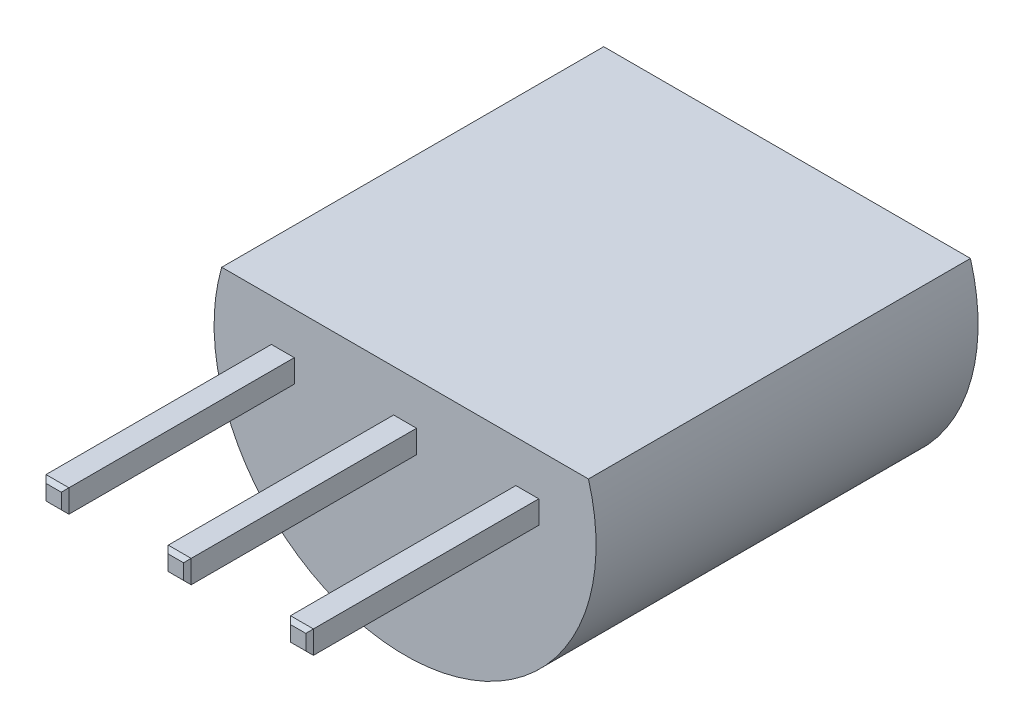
ISO-10303-21;
HEADER;
FILE_DESCRIPTION(('STEP AP214'),'2;1');
FILE_NAME('part.step','',(''),(''),'','','');
FILE_SCHEMA(('AUTOMOTIVE_DESIGN { 1 0 10303 214 1 1 1 1 }'));
ENDSEC;
DATA;
#1=APPLICATION_CONTEXT('core data for automotive mechanical design processes');
#2=APPLICATION_PROTOCOL_DEFINITION('international standard','automotive_design',2000,#1);
#3=PRODUCT_CONTEXT('',#1,'mechanical');
#4=PRODUCT('Part','Part','',(#3));
#5=PRODUCT_RELATED_PRODUCT_CATEGORY('part','',(#4));
#6=PRODUCT_DEFINITION_FORMATION('','',#4);
#7=PRODUCT_DEFINITION_CONTEXT('part definition',#1,'design');
#8=PRODUCT_DEFINITION('design','',#6,#7);
#9=PRODUCT_DEFINITION_SHAPE('','',#8);
#10=(LENGTH_UNIT() NAMED_UNIT(*) SI_UNIT(.MILLI.,.METRE.));
#11=(NAMED_UNIT(*) PLANE_ANGLE_UNIT() SI_UNIT($,.RADIAN.));
#12=(NAMED_UNIT(*) SI_UNIT($,.STERADIAN.) SOLID_ANGLE_UNIT());
#13=UNCERTAINTY_MEASURE_WITH_UNIT(LENGTH_MEASURE(1.E-05),#10,'distance_accuracy_value','');
#14=(GEOMETRIC_REPRESENTATION_CONTEXT(3) GLOBAL_UNCERTAINTY_ASSIGNED_CONTEXT((#13)) GLOBAL_UNIT_ASSIGNED_CONTEXT((#10,
#11,#12)) REPRESENTATION_CONTEXT('',''));
#15=CARTESIAN_POINT('',(0.,0.,0.));
#16=DIRECTION('',(0.,0.,1.));
#17=DIRECTION('',(1.,0.,0.));
#18=AXIS2_PLACEMENT_3D('',#15,#16,#17);
#19=CARTESIAN_POINT('',(0.,0.,0.));
#20=DIRECTION('',(0.,0.,1.));
#21=DIRECTION('',(1.,0.,0.));
#22=AXIS2_PLACEMENT_3D('',#19,#20,#21);
#23=PLANE('',#22);
#24=DIRECTION('',(1.,0.,0.));
#25=VECTOR('',#24,1.);
#26=CARTESIAN_POINT('',(0.,0.7,0.));
#27=LINE('',#26,#25);
#28=CARTESIAN_POINT('',(-2.4,0.7,0.));
#29=VERTEX_POINT('',#28);
#30=CARTESIAN_POINT('',(2.4,0.7,0.));
#31=VERTEX_POINT('',#30);
#32=EDGE_CURVE('E176',#29,#31,#27,.T.);
#33=ORIENTED_EDGE('',*,*,#32,.F.);
#34=CARTESIAN_POINT('',(0.,0.,0.));
#35=DIRECTION('',(0.,0.,1.));
#36=DIRECTION('',(1.,0.,0.));
#37=AXIS2_PLACEMENT_3D('',#34,#35,#36);
#38=CIRCLE('',#37,2.5);
#39=EDGE_CURVE('E175',#29,#31,#38,.T.);
#40=ORIENTED_EDGE('',*,*,#39,.T.);
#41=EDGE_LOOP('',(#33,#40));
#42=FACE_BOUND('',#41,.T.);
#43=DIRECTION('',(0.,-1.,0.));
#44=VECTOR('',#43,1.);
#45=CARTESIAN_POINT('',(1.45,0.15,0.));
#46=LINE('',#45,#44);
#47=CARTESIAN_POINT('',(1.45,0.15,0.));
#48=VERTEX_POINT('',#47);
#49=CARTESIAN_POINT('',(1.45,-0.15,0.));
#50=VERTEX_POINT('',#49);
#51=EDGE_CURVE('E319',#48,#50,#46,.T.);
#52=ORIENTED_EDGE('',*,*,#51,.F.);
#53=DIRECTION('',(-1.,0.,0.));
#54=VECTOR('',#53,1.);
#55=CARTESIAN_POINT('',(1.45,0.15,0.));
#56=LINE('',#55,#54);
#57=CARTESIAN_POINT('',(1.75,0.15,0.));
#58=VERTEX_POINT('',#57);
#59=EDGE_CURVE('E316',#58,#48,#56,.T.);
#60=ORIENTED_EDGE('',*,*,#59,.F.);
#61=DIRECTION('',(0.,1.,0.));
#62=VECTOR('',#61,1.);
#63=CARTESIAN_POINT('',(1.75,0.15,0.));
#64=LINE('',#63,#62);
#65=CARTESIAN_POINT('',(1.75,-0.15,0.));
#66=VERTEX_POINT('',#65);
#67=EDGE_CURVE('E325',#66,#58,#64,.T.);
#68=ORIENTED_EDGE('',*,*,#67,.F.);
#69=DIRECTION('',(1.,0.,0.));
#70=VECTOR('',#69,1.);
#71=CARTESIAN_POINT('',(1.45,-0.15,0.));
#72=LINE('',#71,#70);
#73=EDGE_CURVE('E322',#50,#66,#72,.T.);
#74=ORIENTED_EDGE('',*,*,#73,.F.);
#75=EDGE_LOOP('',(#52,#60,#68,#74));
#76=FACE_BOUND('',#75,.T.);
#77=DIRECTION('',(-1.,0.,0.));
#78=VECTOR('',#77,1.);
#79=CARTESIAN_POINT('',(-1.45,0.15,0.));
#80=LINE('',#79,#78);
#81=CARTESIAN_POINT('',(-1.45,0.15,0.));
#82=VERTEX_POINT('',#81);
#83=CARTESIAN_POINT('',(-1.75,0.15,0.));
#84=VERTEX_POINT('',#83);
#85=EDGE_CURVE('E338',#82,#84,#80,.T.);
#86=ORIENTED_EDGE('',*,*,#85,.F.);
#87=DIRECTION('',(0.,1.,0.));
#88=VECTOR('',#87,1.);
#89=CARTESIAN_POINT('',(-1.45,0.15,0.));
#90=LINE('',#89,#88);
#91=CARTESIAN_POINT('',(-1.45,-0.15,0.));
#92=VERTEX_POINT('',#91);
#93=EDGE_CURVE('E336',#92,#82,#90,.T.);
#94=ORIENTED_EDGE('',*,*,#93,.F.);
#95=DIRECTION('',(1.,0.,0.));
#96=VECTOR('',#95,1.);
#97=CARTESIAN_POINT('',(-1.45,-0.15,0.));
#98=LINE('',#97,#96);
#99=CARTESIAN_POINT('',(-1.75,-0.15,0.));
#100=VERTEX_POINT('',#99);
#101=EDGE_CURVE('E251',#100,#92,#98,.T.);
#102=ORIENTED_EDGE('',*,*,#101,.F.);
#103=DIRECTION('',(0.,-1.,0.));
#104=VECTOR('',#103,1.);
#105=CARTESIAN_POINT('',(-1.75,0.15,0.));
#106=LINE('',#105,#104);
#107=EDGE_CURVE('E341',#84,#100,#106,.T.);
#108=ORIENTED_EDGE('',*,*,#107,.F.);
#109=EDGE_LOOP('',(#86,#94,#102,#108));
#110=FACE_BOUND('',#109,.T.);
#111=DIRECTION('',(1.,0.,0.));
#112=VECTOR('',#111,1.);
#113=CARTESIAN_POINT('',(-0.15,-0.15,0.));
#114=LINE('',#113,#112);
#115=CARTESIAN_POINT('',(-0.15,-0.15,0.));
#116=VERTEX_POINT('',#115);
#117=CARTESIAN_POINT('',(0.15,-0.15,0.));
#118=VERTEX_POINT('',#117);
#119=EDGE_CURVE('E299',#116,#118,#114,.T.);
#120=ORIENTED_EDGE('',*,*,#119,.F.);
#121=DIRECTION('',(0.,-1.,0.));
#122=VECTOR('',#121,1.);
#123=CARTESIAN_POINT('',(-0.15,0.15,0.));
#124=LINE('',#123,#122);
#125=CARTESIAN_POINT('',(-0.15,0.15,0.));
#126=VERTEX_POINT('',#125);
#127=EDGE_CURVE('E296',#126,#116,#124,.T.);
#128=ORIENTED_EDGE('',*,*,#127,.F.);
#129=DIRECTION('',(-1.,0.,0.));
#130=VECTOR('',#129,1.);
#131=CARTESIAN_POINT('',(-0.15,0.15,0.));
#132=LINE('',#131,#130);
#133=CARTESIAN_POINT('',(0.15,0.15,0.));
#134=VERTEX_POINT('',#133);
#135=EDGE_CURVE('E305',#134,#126,#132,.T.);
#136=ORIENTED_EDGE('',*,*,#135,.F.);
#137=DIRECTION('',(0.,1.,0.));
#138=VECTOR('',#137,1.);
#139=CARTESIAN_POINT('',(0.15,0.15,0.));
#140=LINE('',#139,#138);
#141=EDGE_CURVE('E302',#118,#134,#140,.T.);
#142=ORIENTED_EDGE('',*,*,#141,.F.);
#143=EDGE_LOOP('',(#120,#128,#136,#142));
#144=FACE_BOUND('',#143,.T.);
#145=ADVANCED_FACE('F31',(#42,#76,#110,#144),#23,.T.);
#146=CARTESIAN_POINT('',(0.,0.,-5.));
#147=DIRECTION('',(0.,0.,1.));
#148=DIRECTION('',(1.,0.,0.));
#149=AXIS2_PLACEMENT_3D('',#146,#147,#148);
#150=CYLINDRICAL_SURFACE('',#149,2.5);
#151=DIRECTION('',(0.,0.,1.));
#152=VECTOR('',#151,1.);
#153=CARTESIAN_POINT('',(2.4,0.7,-5.));
#154=LINE('',#153,#152);
#155=CARTESIAN_POINT('',(2.4,0.7,-5.));
#156=VERTEX_POINT('',#155);
#157=EDGE_CURVE('E46',#31,#156,#154,.F.);
#158=ORIENTED_EDGE('',*,*,#157,.F.);
#159=ORIENTED_EDGE('',*,*,#39,.F.);
#160=DIRECTION('',(0.,0.,1.));
#161=VECTOR('',#160,1.);
#162=CARTESIAN_POINT('',(-2.4,0.7,-5.));
#163=LINE('',#162,#161);
#164=CARTESIAN_POINT('',(-2.4,0.7,-5.));
#165=VERTEX_POINT('',#164);
#166=EDGE_CURVE('E166',#165,#29,#163,.T.);
#167=ORIENTED_EDGE('',*,*,#166,.F.);
#168=CARTESIAN_POINT('',(0.,0.,-5.));
#169=DIRECTION('',(0.,0.,1.));
#170=DIRECTION('',(1.,0.,0.));
#171=AXIS2_PLACEMENT_3D('',#168,#169,#170);
#172=CIRCLE('',#171,2.5);
#173=EDGE_CURVE('E173',#165,#156,#172,.T.);
#174=ORIENTED_EDGE('',*,*,#173,.T.);
#175=EDGE_LOOP('',(#158,#159,#167,#174));
#176=FACE_BOUND('',#175,.T.);
#177=ADVANCED_FACE('F33',(#176),#150,.T.);
#178=CARTESIAN_POINT('',(0.,0.,-5.));
#179=DIRECTION('',(0.,0.,1.));
#180=DIRECTION('',(1.,0.,0.));
#181=AXIS2_PLACEMENT_3D('',#178,#179,#180);
#182=PLANE('',#181);
#183=ORIENTED_EDGE('',*,*,#173,.F.);
#184=DIRECTION('',(1.,0.,0.));
#185=VECTOR('',#184,1.);
#186=CARTESIAN_POINT('',(0.,0.7,-5.));
#187=LINE('',#186,#185);
#188=EDGE_CURVE('E11',#165,#156,#187,.T.);
#189=ORIENTED_EDGE('',*,*,#188,.T.);
#190=EDGE_LOOP('',(#183,#189));
#191=FACE_BOUND('',#190,.T.);
#192=ADVANCED_FACE('F178',(#191),#182,.F.);
#193=CARTESIAN_POINT('',(-1.45,0.15,3.));
#194=DIRECTION('',(-1.,0.,0.));
#195=DIRECTION('',(0.,0.,1.));
#196=AXIS2_PLACEMENT_3D('',#193,#194,#195);
#197=PLANE('',#196);
#198=DIRECTION('',(0.,0.,-1.));
#199=VECTOR('',#198,1.);
#200=CARTESIAN_POINT('',(-1.45,0.15,3.));
#201=LINE('',#200,#199);
#202=CARTESIAN_POINT('',(-1.45,0.15,2.95));
#203=VERTEX_POINT('',#202);
#204=EDGE_CURVE('E183',#203,#82,#201,.T.);
#205=ORIENTED_EDGE('',*,*,#204,.F.);
#206=DIRECTION('',(0.,-1.,0.));
#207=VECTOR('',#206,1.);
#208=CARTESIAN_POINT('',(-1.45,0.15,2.95));
#209=LINE('',#208,#207);
#210=CARTESIAN_POINT('',(-1.45,-0.15,2.95));
#211=VERTEX_POINT('',#210);
#212=EDGE_CURVE('E234',#203,#211,#209,.T.);
#213=ORIENTED_EDGE('',*,*,#212,.T.);
#214=DIRECTION('',(0.,0.,-1.));
#215=VECTOR('',#214,1.);
#216=CARTESIAN_POINT('',(-1.45,-0.15,3.));
#217=LINE('',#216,#215);
#218=EDGE_CURVE('E240',#211,#92,#217,.T.);
#219=ORIENTED_EDGE('',*,*,#218,.T.);
#220=ORIENTED_EDGE('',*,*,#93,.T.);
#221=EDGE_LOOP('',(#205,#213,#219,#220));
#222=FACE_BOUND('',#221,.T.);
#223=ADVANCED_FACE('F238',(#222),#197,.F.);
#224=CARTESIAN_POINT('',(-1.45,0.15,3.));
#225=DIRECTION('',(0.,-1.,0.));
#226=DIRECTION('',(1.,0.,0.));
#227=AXIS2_PLACEMENT_3D('',#224,#225,#226);
#228=PLANE('',#227);
#229=DIRECTION('',(0.,0.,-1.));
#230=VECTOR('',#229,1.);
#231=CARTESIAN_POINT('',(-1.75,0.15,3.));
#232=LINE('',#231,#230);
#233=CARTESIAN_POINT('',(-1.75,0.15,2.95));
#234=VERTEX_POINT('',#233);
#235=EDGE_CURVE('E346',#234,#84,#232,.T.);
#236=ORIENTED_EDGE('',*,*,#235,.F.);
#237=DIRECTION('',(1.,0.,0.));
#238=VECTOR('',#237,1.);
#239=CARTESIAN_POINT('',(-1.45,0.15,2.95));
#240=LINE('',#239,#238);
#241=EDGE_CURVE('E39',#234,#203,#240,.T.);
#242=ORIENTED_EDGE('',*,*,#241,.T.);
#243=ORIENTED_EDGE('',*,*,#204,.T.);
#244=ORIENTED_EDGE('',*,*,#85,.T.);
#245=EDGE_LOOP('',(#236,#242,#243,#244));
#246=FACE_BOUND('',#245,.T.);
#247=ADVANCED_FACE('F347',(#246),#228,.F.);
#248=CARTESIAN_POINT('',(-1.75,0.15,3.));
#249=DIRECTION('',(1.,0.,0.));
#250=DIRECTION('',(0.,0.,-1.));
#251=AXIS2_PLACEMENT_3D('',#248,#249,#250);
#252=PLANE('',#251);
#253=DIRECTION('',(0.,0.,-1.));
#254=VECTOR('',#253,1.);
#255=CARTESIAN_POINT('',(-1.75,-0.15,3.));
#256=LINE('',#255,#254);
#257=CARTESIAN_POINT('',(-1.75,-0.15,2.95));
#258=VERTEX_POINT('',#257);
#259=EDGE_CURVE('E253',#258,#100,#256,.T.);
#260=ORIENTED_EDGE('',*,*,#259,.F.);
#261=DIRECTION('',(0.,1.,0.));
#262=VECTOR('',#261,1.);
#263=CARTESIAN_POINT('',(-1.75,0.15,2.95));
#264=LINE('',#263,#262);
#265=EDGE_CURVE('E229',#258,#234,#264,.T.);
#266=ORIENTED_EDGE('',*,*,#265,.T.);
#267=ORIENTED_EDGE('',*,*,#235,.T.);
#268=ORIENTED_EDGE('',*,*,#107,.T.);
#269=EDGE_LOOP('',(#260,#266,#267,#268));
#270=FACE_BOUND('',#269,.T.);
#271=ADVANCED_FACE('F353',(#270),#252,.F.);
#272=CARTESIAN_POINT('',(-1.45,-0.15,3.));
#273=DIRECTION('',(0.,1.,0.));
#274=DIRECTION('',(-1.,0.,0.));
#275=AXIS2_PLACEMENT_3D('',#272,#273,#274);
#276=PLANE('',#275);
#277=ORIENTED_EDGE('',*,*,#218,.F.);
#278=DIRECTION('',(-1.,0.,0.));
#279=VECTOR('',#278,1.);
#280=CARTESIAN_POINT('',(-1.45,-0.15,2.95));
#281=LINE('',#280,#279);
#282=EDGE_CURVE('E232',#211,#258,#281,.T.);
#283=ORIENTED_EDGE('',*,*,#282,.T.);
#284=ORIENTED_EDGE('',*,*,#259,.T.);
#285=ORIENTED_EDGE('',*,*,#101,.T.);
#286=EDGE_LOOP('',(#277,#283,#284,#285));
#287=FACE_BOUND('',#286,.T.);
#288=ADVANCED_FACE('F247',(#287),#276,.F.);
#289=CARTESIAN_POINT('',(-1.45,-0.15,3.));
#290=DIRECTION('',(0.,0.,-1.));
#291=DIRECTION('',(-1.,0.,0.));
#292=AXIS2_PLACEMENT_3D('',#289,#290,#291);
#293=PLANE('',#292);
#294=DIRECTION('',(-1.,0.,0.));
#295=VECTOR('',#294,1.);
#296=CARTESIAN_POINT('',(-1.45,0.0999999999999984,3.));
#297=LINE('',#296,#295);
#298=CARTESIAN_POINT('',(-1.5,0.0999999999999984,3.));
#299=VERTEX_POINT('',#298);
#300=CARTESIAN_POINT('',(-1.7,0.0999999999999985,3.));
#301=VERTEX_POINT('',#300);
#302=EDGE_CURVE('E220',#299,#301,#297,.T.);
#303=ORIENTED_EDGE('',*,*,#302,.T.);
#304=DIRECTION('',(0.,-1.,0.));
#305=VECTOR('',#304,1.);
#306=CARTESIAN_POINT('',(-1.7,-0.15,3.));
#307=LINE('',#306,#305);
#308=CARTESIAN_POINT('',(-1.7,-0.0999999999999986,3.));
#309=VERTEX_POINT('',#308);
#310=EDGE_CURVE('E226',#301,#309,#307,.T.);
#311=ORIENTED_EDGE('',*,*,#310,.T.);
#312=DIRECTION('',(1.,0.,0.));
#313=VECTOR('',#312,1.);
#314=CARTESIAN_POINT('',(-1.45,-0.0999999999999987,3.));
#315=LINE('',#314,#313);
#316=CARTESIAN_POINT('',(-1.5,-0.0999999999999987,3.));
#317=VERTEX_POINT('',#316);
#318=EDGE_CURVE('E224',#309,#317,#315,.T.);
#319=ORIENTED_EDGE('',*,*,#318,.T.);
#320=DIRECTION('',(0.,1.,0.));
#321=VECTOR('',#320,1.);
#322=CARTESIAN_POINT('',(-1.5,-0.15,3.));
#323=LINE('',#322,#321);
#324=EDGE_CURVE('E222',#317,#299,#323,.T.);
#325=ORIENTED_EDGE('',*,*,#324,.T.);
#326=EDGE_LOOP('',(#303,#311,#319,#325));
#327=FACE_BOUND('',#326,.T.);
#328=ADVANCED_FACE('F360',(#327),#293,.F.);
#329=CARTESIAN_POINT('',(1.45,0.15,3.));
#330=DIRECTION('',(0.,-1.,0.));
#331=DIRECTION('',(1.,0.,0.));
#332=AXIS2_PLACEMENT_3D('',#329,#330,#331);
#333=PLANE('',#332);
#334=DIRECTION('',(0.,0.,-1.));
#335=VECTOR('',#334,1.);
#336=CARTESIAN_POINT('',(1.45,0.15,3.));
#337=LINE('',#336,#335);
#338=CARTESIAN_POINT('',(1.45,0.15,2.95));
#339=VERTEX_POINT('',#338);
#340=EDGE_CURVE('E334',#339,#48,#337,.T.);
#341=ORIENTED_EDGE('',*,*,#340,.F.);
#342=DIRECTION('',(1.,0.,0.));
#343=VECTOR('',#342,1.);
#344=CARTESIAN_POINT('',(1.45,0.15,2.95));
#345=LINE('',#344,#343);
#346=CARTESIAN_POINT('',(1.75,0.15,2.95));
#347=VERTEX_POINT('',#346);
#348=EDGE_CURVE('E200',#339,#347,#345,.T.);
#349=ORIENTED_EDGE('',*,*,#348,.T.);
#350=DIRECTION('',(0.,0.,-1.));
#351=VECTOR('',#350,1.);
#352=CARTESIAN_POINT('',(1.75,0.15,3.));
#353=LINE('',#352,#351);
#354=EDGE_CURVE('E328',#347,#58,#353,.T.);
#355=ORIENTED_EDGE('',*,*,#354,.T.);
#356=ORIENTED_EDGE('',*,*,#59,.T.);
#357=EDGE_LOOP('',(#341,#349,#355,#356));
#358=FACE_BOUND('',#357,.T.);
#359=ADVANCED_FACE('F362',(#358),#333,.F.);
#360=CARTESIAN_POINT('',(1.45,0.15,3.));
#361=DIRECTION('',(1.,0.,0.));
#362=DIRECTION('',(0.,1.,0.));
#363=AXIS2_PLACEMENT_3D('',#360,#361,#362);
#364=PLANE('',#363);
#365=DIRECTION('',(0.,0.,-1.));
#366=VECTOR('',#365,1.);
#367=CARTESIAN_POINT('',(1.45,-0.15,3.));
#368=LINE('',#367,#366);
#369=CARTESIAN_POINT('',(1.45,-0.15,2.95));
#370=VERTEX_POINT('',#369);
#371=EDGE_CURVE('E332',#370,#50,#368,.T.);
#372=ORIENTED_EDGE('',*,*,#371,.F.);
#373=DIRECTION('',(0.,1.,0.));
#374=VECTOR('',#373,1.);
#375=CARTESIAN_POINT('',(1.45,0.15,2.95));
#376=LINE('',#375,#374);
#377=EDGE_CURVE('E198',#370,#339,#376,.T.);
#378=ORIENTED_EDGE('',*,*,#377,.T.);
#379=ORIENTED_EDGE('',*,*,#340,.T.);
#380=ORIENTED_EDGE('',*,*,#51,.T.);
#381=EDGE_LOOP('',(#372,#378,#379,#380));
#382=FACE_BOUND('',#381,.T.);
#383=ADVANCED_FACE('F368',(#382),#364,.F.);
#384=CARTESIAN_POINT('',(1.45,-0.15,3.));
#385=DIRECTION('',(0.,1.,0.));
#386=DIRECTION('',(-1.,0.,0.));
#387=AXIS2_PLACEMENT_3D('',#384,#385,#386);
#388=PLANE('',#387);
#389=DIRECTION('',(0.,0.,-1.));
#390=VECTOR('',#389,1.);
#391=CARTESIAN_POINT('',(1.75,-0.15,3.));
#392=LINE('',#391,#390);
#393=CARTESIAN_POINT('',(1.75,-0.15,2.95));
#394=VERTEX_POINT('',#393);
#395=EDGE_CURVE('E330',#394,#66,#392,.T.);
#396=ORIENTED_EDGE('',*,*,#395,.F.);
#397=DIRECTION('',(-1.,0.,0.));
#398=VECTOR('',#397,1.);
#399=CARTESIAN_POINT('',(1.45,-0.15,2.95));
#400=LINE('',#399,#398);
#401=EDGE_CURVE('E196',#394,#370,#400,.T.);
#402=ORIENTED_EDGE('',*,*,#401,.T.);
#403=ORIENTED_EDGE('',*,*,#371,.T.);
#404=ORIENTED_EDGE('',*,*,#73,.T.);
#405=EDGE_LOOP('',(#396,#402,#403,#404));
#406=FACE_BOUND('',#405,.T.);
#407=ADVANCED_FACE('F417',(#406),#388,.F.);
#408=CARTESIAN_POINT('',(1.75,0.15,3.));
#409=DIRECTION('',(-1.,0.,0.));
#410=DIRECTION('',(0.,-1.,0.));
#411=AXIS2_PLACEMENT_3D('',#408,#409,#410);
#412=PLANE('',#411);
#413=ORIENTED_EDGE('',*,*,#354,.F.);
#414=DIRECTION('',(0.,-1.,0.));
#415=VECTOR('',#414,1.);
#416=CARTESIAN_POINT('',(1.75,0.15,2.95));
#417=LINE('',#416,#415);
#418=EDGE_CURVE('E193',#347,#394,#417,.T.);
#419=ORIENTED_EDGE('',*,*,#418,.T.);
#420=ORIENTED_EDGE('',*,*,#395,.T.);
#421=ORIENTED_EDGE('',*,*,#67,.T.);
#422=EDGE_LOOP('',(#413,#419,#420,#421));
#423=FACE_BOUND('',#422,.T.);
#424=ADVANCED_FACE('F427',(#423),#412,.F.);
#425=CARTESIAN_POINT('',(1.75,0.15,3.));
#426=DIRECTION('',(0.,0.,-1.));
#427=DIRECTION('',(-1.,0.,0.));
#428=AXIS2_PLACEMENT_3D('',#425,#426,#427);
#429=PLANE('',#428);
#430=DIRECTION('',(1.,0.,0.));
#431=VECTOR('',#430,1.);
#432=CARTESIAN_POINT('',(1.75,-0.0999999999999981,3.));
#433=LINE('',#432,#431);
#434=CARTESIAN_POINT('',(1.5,-0.0999999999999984,3.));
#435=VERTEX_POINT('',#434);
#436=CARTESIAN_POINT('',(1.7,-0.0999999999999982,3.));
#437=VERTEX_POINT('',#436);
#438=EDGE_CURVE('E188',#435,#437,#433,.T.);
#439=ORIENTED_EDGE('',*,*,#438,.T.);
#440=DIRECTION('',(0.,1.,0.));
#441=VECTOR('',#440,1.);
#442=CARTESIAN_POINT('',(1.7,0.15,3.));
#443=LINE('',#442,#441);
#444=CARTESIAN_POINT('',(1.7,0.099999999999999,3.));
#445=VERTEX_POINT('',#444);
#446=EDGE_CURVE('E190',#437,#445,#443,.T.);
#447=ORIENTED_EDGE('',*,*,#446,.T.);
#448=DIRECTION('',(-1.,0.,0.));
#449=VECTOR('',#448,1.);
#450=CARTESIAN_POINT('',(1.75,0.099999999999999,3.));
#451=LINE('',#450,#449);
#452=CARTESIAN_POINT('',(1.5,0.0999999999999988,3.));
#453=VERTEX_POINT('',#452);
#454=EDGE_CURVE('E179',#445,#453,#451,.T.);
#455=ORIENTED_EDGE('',*,*,#454,.T.);
#456=DIRECTION('',(0.,-1.,0.));
#457=VECTOR('',#456,1.);
#458=CARTESIAN_POINT('',(1.5,0.15,3.));
#459=LINE('',#458,#457);
#460=EDGE_CURVE('E181',#453,#435,#459,.T.);
#461=ORIENTED_EDGE('',*,*,#460,.T.);
#462=EDGE_LOOP('',(#439,#447,#455,#461));
#463=FACE_BOUND('',#462,.T.);
#464=ADVANCED_FACE('F437',(#463),#429,.F.);
#465=CARTESIAN_POINT('',(-0.15,0.15,3.));
#466=DIRECTION('',(1.,0.,0.));
#467=DIRECTION('',(0.,1.,0.));
#468=AXIS2_PLACEMENT_3D('',#465,#466,#467);
#469=PLANE('',#468);
#470=DIRECTION('',(0.,0.,-1.));
#471=VECTOR('',#470,1.);
#472=CARTESIAN_POINT('',(-0.15,-0.15,3.));
#473=LINE('',#472,#471);
#474=CARTESIAN_POINT('',(-0.15,-0.15,2.95));
#475=VERTEX_POINT('',#474);
#476=EDGE_CURVE('E314',#475,#116,#473,.T.);
#477=ORIENTED_EDGE('',*,*,#476,.F.);
#478=DIRECTION('',(0.,1.,0.));
#479=VECTOR('',#478,1.);
#480=CARTESIAN_POINT('',(-0.15,0.15,2.95));
#481=LINE('',#480,#479);
#482=CARTESIAN_POINT('',(-0.15,0.15,2.95));
#483=VERTEX_POINT('',#482);
#484=EDGE_CURVE('E218',#475,#483,#481,.T.);
#485=ORIENTED_EDGE('',*,*,#484,.T.);
#486=DIRECTION('',(0.,0.,-1.));
#487=VECTOR('',#486,1.);
#488=CARTESIAN_POINT('',(-0.15,0.15,3.));
#489=LINE('',#488,#487);
#490=EDGE_CURVE('E308',#483,#126,#489,.T.);
#491=ORIENTED_EDGE('',*,*,#490,.T.);
#492=ORIENTED_EDGE('',*,*,#127,.T.);
#493=EDGE_LOOP('',(#477,#485,#491,#492));
#494=FACE_BOUND('',#493,.T.);
#495=ADVANCED_FACE('F447',(#494),#469,.F.);
#496=CARTESIAN_POINT('',(-0.15,-0.15,3.));
#497=DIRECTION('',(0.,1.,0.));
#498=DIRECTION('',(0.,0.,1.));
#499=AXIS2_PLACEMENT_3D('',#496,#497,#498);
#500=PLANE('',#499);
#501=DIRECTION('',(0.,0.,-1.));
#502=VECTOR('',#501,1.);
#503=CARTESIAN_POINT('',(0.15,-0.15,3.));
#504=LINE('',#503,#502);
#505=CARTESIAN_POINT('',(0.15,-0.15,2.95));
#506=VERTEX_POINT('',#505);
#507=EDGE_CURVE('E312',#506,#118,#504,.T.);
#508=ORIENTED_EDGE('',*,*,#507,.F.);
#509=DIRECTION('',(-1.,0.,0.));
#510=VECTOR('',#509,1.);
#511=CARTESIAN_POINT('',(-0.15,-0.15,2.95));
#512=LINE('',#511,#510);
#513=EDGE_CURVE('E216',#506,#475,#512,.T.);
#514=ORIENTED_EDGE('',*,*,#513,.T.);
#515=ORIENTED_EDGE('',*,*,#476,.T.);
#516=ORIENTED_EDGE('',*,*,#119,.T.);
#517=EDGE_LOOP('',(#508,#514,#515,#516));
#518=FACE_BOUND('',#517,.T.);
#519=ADVANCED_FACE('F457',(#518),#500,.F.);
#520=CARTESIAN_POINT('',(0.15,0.15,3.));
#521=DIRECTION('',(-1.,0.,0.));
#522=DIRECTION('',(0.,-1.,0.));
#523=AXIS2_PLACEMENT_3D('',#520,#521,#522);
#524=PLANE('',#523);
#525=DIRECTION('',(0.,0.,-1.));
#526=VECTOR('',#525,1.);
#527=CARTESIAN_POINT('',(0.15,0.15,3.));
#528=LINE('',#527,#526);
#529=CARTESIAN_POINT('',(0.15,0.15,2.95));
#530=VERTEX_POINT('',#529);
#531=EDGE_CURVE('E310',#530,#134,#528,.T.);
#532=ORIENTED_EDGE('',*,*,#531,.F.);
#533=DIRECTION('',(0.,-1.,0.));
#534=VECTOR('',#533,1.);
#535=CARTESIAN_POINT('',(0.15,-0.15,2.95));
#536=LINE('',#535,#534);
#537=EDGE_CURVE('E214',#530,#506,#536,.T.);
#538=ORIENTED_EDGE('',*,*,#537,.T.);
#539=ORIENTED_EDGE('',*,*,#507,.T.);
#540=ORIENTED_EDGE('',*,*,#141,.T.);
#541=EDGE_LOOP('',(#532,#538,#539,#540));
#542=FACE_BOUND('',#541,.T.);
#543=ADVANCED_FACE('F467',(#542),#524,.F.);
#544=CARTESIAN_POINT('',(-0.15,0.15,3.));
#545=DIRECTION('',(0.,-1.,0.));
#546=DIRECTION('',(0.,0.,-1.));
#547=AXIS2_PLACEMENT_3D('',#544,#545,#546);
#548=PLANE('',#547);
#549=ORIENTED_EDGE('',*,*,#490,.F.);
#550=DIRECTION('',(1.,0.,0.));
#551=VECTOR('',#550,1.);
#552=CARTESIAN_POINT('',(0.15,0.15,2.95));
#553=LINE('',#552,#551);
#554=EDGE_CURVE('E211',#483,#530,#553,.T.);
#555=ORIENTED_EDGE('',*,*,#554,.T.);
#556=ORIENTED_EDGE('',*,*,#531,.T.);
#557=ORIENTED_EDGE('',*,*,#135,.T.);
#558=EDGE_LOOP('',(#549,#555,#556,#557));
#559=FACE_BOUND('',#558,.T.);
#560=ADVANCED_FACE('F477',(#559),#548,.F.);
#561=CARTESIAN_POINT('',(-0.15,-0.15,3.));
#562=DIRECTION('',(0.,0.,1.));
#563=DIRECTION('',(1.,0.,0.));
#564=AXIS2_PLACEMENT_3D('',#561,#562,#563);
#565=PLANE('',#564);
#566=DIRECTION('',(0.,1.,0.));
#567=VECTOR('',#566,1.);
#568=CARTESIAN_POINT('',(0.0999999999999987,0.15,3.));
#569=LINE('',#568,#567);
#570=CARTESIAN_POINT('',(0.0999999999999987,-0.0999999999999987,3.));
#571=VERTEX_POINT('',#570);
#572=CARTESIAN_POINT('',(0.0999999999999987,0.0999999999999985,3.));
#573=VERTEX_POINT('',#572);
#574=EDGE_CURVE('E206',#571,#573,#569,.T.);
#575=ORIENTED_EDGE('',*,*,#574,.T.);
#576=DIRECTION('',(-1.,0.,0.));
#577=VECTOR('',#576,1.);
#578=CARTESIAN_POINT('',(-0.15,0.0999999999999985,3.));
#579=LINE('',#578,#577);
#580=CARTESIAN_POINT('',(-0.0999999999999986,0.0999999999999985,3.));
#581=VERTEX_POINT('',#580);
#582=EDGE_CURVE('E208',#573,#581,#579,.T.);
#583=ORIENTED_EDGE('',*,*,#582,.T.);
#584=DIRECTION('',(0.,-1.,0.));
#585=VECTOR('',#584,1.);
#586=CARTESIAN_POINT('',(-0.0999999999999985,-0.15,3.));
#587=LINE('',#586,#585);
#588=CARTESIAN_POINT('',(-0.0999999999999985,-0.0999999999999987,3.));
#589=VERTEX_POINT('',#588);
#590=EDGE_CURVE('E202',#581,#589,#587,.T.);
#591=ORIENTED_EDGE('',*,*,#590,.T.);
#592=DIRECTION('',(1.,0.,0.));
#593=VECTOR('',#592,1.);
#594=CARTESIAN_POINT('',(0.15,-0.0999999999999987,3.));
#595=LINE('',#594,#593);
#596=EDGE_CURVE('E204',#589,#571,#595,.T.);
#597=ORIENTED_EDGE('',*,*,#596,.T.);
#598=EDGE_LOOP('',(#575,#583,#591,#597));
#599=FACE_BOUND('',#598,.T.);
#600=ADVANCED_FACE('F487',(#599),#565,.T.);
#601=CARTESIAN_POINT('',(1.5,0.15,3.));
#602=DIRECTION('',(0.707106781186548,0.,-0.707106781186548));
#603=DIRECTION('',(-0.707106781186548,0.,-0.707106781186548));
#604=AXIS2_PLACEMENT_3D('',#601,#602,#603);
#605=PLANE('',#604);
#606=DIRECTION('',(0.577350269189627,-0.577350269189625,0.577350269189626));
#607=VECTOR('',#606,1.);
#608=CARTESIAN_POINT('',(1.58333333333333,0.016666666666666,3.08333333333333));
#609=LINE('',#608,#607);
#610=EDGE_CURVE('E290',#339,#453,#609,.T.);
#611=ORIENTED_EDGE('',*,*,#610,.F.);
#612=ORIENTED_EDGE('',*,*,#377,.F.);
#613=DIRECTION('',(0.577350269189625,0.577350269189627,0.577350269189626));
#614=VECTOR('',#613,1.);
#615=CARTESIAN_POINT('',(1.58333333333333,-0.0166666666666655,3.08333333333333));
#616=LINE('',#615,#614);
#617=EDGE_CURVE('E293',#435,#370,#616,.F.);
#618=ORIENTED_EDGE('',*,*,#617,.F.);
#619=ORIENTED_EDGE('',*,*,#460,.F.);
#620=EDGE_LOOP('',(#611,#612,#618,#619));
#621=FACE_BOUND('',#620,.T.);
#622=ADVANCED_FACE('F497',(#621),#605,.F.);
#623=CARTESIAN_POINT('',(1.75,-0.0999999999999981,3.));
#624=DIRECTION('',(0.,0.707106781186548,-0.707106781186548));
#625=DIRECTION('',(0.,0.707106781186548,0.707106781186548));
#626=AXIS2_PLACEMENT_3D('',#623,#624,#625);
#627=PLANE('',#626);
#628=ORIENTED_EDGE('',*,*,#617,.T.);
#629=ORIENTED_EDGE('',*,*,#401,.F.);
#630=DIRECTION('',(-0.577350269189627,0.577350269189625,0.577350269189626));
#631=VECTOR('',#630,1.);
#632=CARTESIAN_POINT('',(1.71666666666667,-0.116666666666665,2.98333333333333));
#633=LINE('',#632,#631);
#634=EDGE_CURVE('E288',#437,#394,#633,.F.);
#635=ORIENTED_EDGE('',*,*,#634,.F.);
#636=ORIENTED_EDGE('',*,*,#438,.F.);
#637=EDGE_LOOP('',(#628,#629,#635,#636));
#638=FACE_BOUND('',#637,.T.);
#639=ADVANCED_FACE('F507',(#638),#627,.F.);
#640=CARTESIAN_POINT('',(1.75,0.099999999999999,3.));
#641=DIRECTION('',(0.,-0.707106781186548,-0.707106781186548));
#642=DIRECTION('',(0.,0.707106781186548,-0.707106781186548));
#643=AXIS2_PLACEMENT_3D('',#640,#641,#642);
#644=PLANE('',#643);
#645=ORIENTED_EDGE('',*,*,#610,.T.);
#646=ORIENTED_EDGE('',*,*,#454,.F.);
#647=DIRECTION('',(0.577350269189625,0.577350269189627,-0.577350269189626));
#648=VECTOR('',#647,1.);
#649=CARTESIAN_POINT('',(1.71666666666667,0.116666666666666,2.98333333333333));
#650=LINE('',#649,#648);
#651=EDGE_CURVE('E286',#347,#445,#650,.F.);
#652=ORIENTED_EDGE('',*,*,#651,.F.);
#653=ORIENTED_EDGE('',*,*,#348,.F.);
#654=EDGE_LOOP('',(#645,#646,#652,#653));
#655=FACE_BOUND('',#654,.T.);
#656=ADVANCED_FACE('F517',(#655),#644,.F.);
#657=CARTESIAN_POINT('',(1.7,0.15,3.));
#658=DIRECTION('',(-0.707106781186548,0.,-0.707106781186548));
#659=DIRECTION('',(-0.707106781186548,0.,0.707106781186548));
#660=AXIS2_PLACEMENT_3D('',#657,#658,#659);
#661=PLANE('',#660);
#662=ORIENTED_EDGE('',*,*,#634,.T.);
#663=ORIENTED_EDGE('',*,*,#418,.F.);
#664=ORIENTED_EDGE('',*,*,#651,.T.);
#665=ORIENTED_EDGE('',*,*,#446,.F.);
#666=EDGE_LOOP('',(#662,#663,#664,#665));
#667=FACE_BOUND('',#666,.T.);
#668=ADVANCED_FACE('F527',(#667),#661,.F.);
#669=CARTESIAN_POINT('',(-0.15,-0.0999999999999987,3.));
#670=DIRECTION('',(0.,-0.707106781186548,0.707106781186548));
#671=DIRECTION('',(0.,-0.707106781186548,-0.707106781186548));
#672=AXIS2_PLACEMENT_3D('',#669,#670,#671);
#673=PLANE('',#672);
#674=DIRECTION('',(0.577350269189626,0.577350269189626,0.577350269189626));
#675=VECTOR('',#674,1.);
#676=CARTESIAN_POINT('',(-0.116666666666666,-0.116666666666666,2.98333333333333));
#677=LINE('',#676,#675);
#678=EDGE_CURVE('E280',#475,#589,#677,.T.);
#679=ORIENTED_EDGE('',*,*,#678,.F.);
#680=ORIENTED_EDGE('',*,*,#513,.F.);
#681=DIRECTION('',(-0.577350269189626,0.577350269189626,0.577350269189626));
#682=VECTOR('',#681,1.);
#683=CARTESIAN_POINT('',(0.0166666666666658,-0.0166666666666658,3.08333333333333));
#684=LINE('',#683,#682);
#685=EDGE_CURVE('E283',#571,#506,#684,.F.);
#686=ORIENTED_EDGE('',*,*,#685,.F.);
#687=ORIENTED_EDGE('',*,*,#596,.F.);
#688=EDGE_LOOP('',(#679,#680,#686,#687));
#689=FACE_BOUND('',#688,.T.);
#690=ADVANCED_FACE('F537',(#689),#673,.T.);
#691=CARTESIAN_POINT('',(0.0999999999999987,-0.15,3.));
#692=DIRECTION('',(0.707106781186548,0.,0.707106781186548));
#693=DIRECTION('',(0.707106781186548,0.,-0.707106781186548));
#694=AXIS2_PLACEMENT_3D('',#691,#692,#693);
#695=PLANE('',#694);
#696=ORIENTED_EDGE('',*,*,#685,.T.);
#697=ORIENTED_EDGE('',*,*,#537,.F.);
#698=DIRECTION('',(-0.577350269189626,-0.577350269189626,0.577350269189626));
#699=VECTOR('',#698,1.);
#700=CARTESIAN_POINT('',(0.0166666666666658,0.0166666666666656,3.08333333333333));
#701=LINE('',#700,#699);
#702=EDGE_CURVE('E278',#573,#530,#701,.F.);
#703=ORIENTED_EDGE('',*,*,#702,.F.);
#704=ORIENTED_EDGE('',*,*,#574,.F.);
#705=EDGE_LOOP('',(#696,#697,#703,#704));
#706=FACE_BOUND('',#705,.T.);
#707=ADVANCED_FACE('F547',(#706),#695,.T.);
#708=CARTESIAN_POINT('',(-0.0999999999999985,-0.15,3.));
#709=DIRECTION('',(-0.707106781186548,0.,0.707106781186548));
#710=DIRECTION('',(0.707106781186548,0.,0.707106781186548));
#711=AXIS2_PLACEMENT_3D('',#708,#709,#710);
#712=PLANE('',#711);
#713=ORIENTED_EDGE('',*,*,#678,.T.);
#714=ORIENTED_EDGE('',*,*,#590,.F.);
#715=DIRECTION('',(-0.577350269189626,0.577350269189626,-0.577350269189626));
#716=VECTOR('',#715,1.);
#717=CARTESIAN_POINT('',(-0.0166666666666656,0.0166666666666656,3.08333333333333));
#718=LINE('',#717,#716);
#719=EDGE_CURVE('E276',#483,#581,#718,.F.);
#720=ORIENTED_EDGE('',*,*,#719,.F.);
#721=ORIENTED_EDGE('',*,*,#484,.F.);
#722=EDGE_LOOP('',(#713,#714,#720,#721));
#723=FACE_BOUND('',#722,.T.);
#724=ADVANCED_FACE('F557',(#723),#712,.T.);
#725=CARTESIAN_POINT('',(-0.15,0.0999999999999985,3.));
#726=DIRECTION('',(0.,0.707106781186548,0.707106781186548));
#727=DIRECTION('',(0.,-0.707106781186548,0.707106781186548));
#728=AXIS2_PLACEMENT_3D('',#725,#726,#727);
#729=PLANE('',#728);
#730=ORIENTED_EDGE('',*,*,#702,.T.);
#731=ORIENTED_EDGE('',*,*,#554,.F.);
#732=ORIENTED_EDGE('',*,*,#719,.T.);
#733=ORIENTED_EDGE('',*,*,#582,.F.);
#734=EDGE_LOOP('',(#730,#731,#732,#733));
#735=FACE_BOUND('',#734,.T.);
#736=ADVANCED_FACE('F567',(#735),#729,.T.);
#737=CARTESIAN_POINT('',(-1.5,-0.15,3.));
#738=DIRECTION('',(-0.707106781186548,0.,-0.707106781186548));
#739=DIRECTION('',(-0.707106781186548,0.,0.707106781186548));
#740=AXIS2_PLACEMENT_3D('',#737,#738,#739);
#741=PLANE('',#740);
#742=DIRECTION('',(0.577350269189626,-0.577350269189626,-0.577350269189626));
#743=VECTOR('',#742,1.);
#744=CARTESIAN_POINT('',(-1.48333333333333,-0.116666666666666,2.98333333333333));
#745=LINE('',#744,#743);
#746=EDGE_CURVE('E257',#211,#317,#745,.F.);
#747=ORIENTED_EDGE('',*,*,#746,.F.);
#748=ORIENTED_EDGE('',*,*,#212,.F.);
#749=DIRECTION('',(0.577350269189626,0.577350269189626,-0.577350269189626));
#750=VECTOR('',#749,1.);
#751=CARTESIAN_POINT('',(-1.48333333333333,0.116666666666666,2.98333333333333));
#752=LINE('',#751,#750);
#753=EDGE_CURVE('E261',#299,#203,#752,.T.);
#754=ORIENTED_EDGE('',*,*,#753,.F.);
#755=ORIENTED_EDGE('',*,*,#324,.F.);
#756=EDGE_LOOP('',(#747,#748,#754,#755));
#757=FACE_BOUND('',#756,.T.);
#758=ADVANCED_FACE('F258',(#757),#741,.F.);
#759=CARTESIAN_POINT('',(-1.45,0.0999999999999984,3.));
#760=DIRECTION('',(0.,-0.707106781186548,-0.707106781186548));
#761=DIRECTION('',(0.,0.707106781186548,-0.707106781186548));
#762=AXIS2_PLACEMENT_3D('',#759,#760,#761);
#763=PLANE('',#762);
#764=ORIENTED_EDGE('',*,*,#753,.T.);
#765=ORIENTED_EDGE('',*,*,#241,.F.);
#766=DIRECTION('',(0.577350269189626,-0.577350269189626,0.577350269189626));
#767=VECTOR('',#766,1.);
#768=CARTESIAN_POINT('',(-1.61666666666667,0.0166666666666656,3.08333333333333));
#769=LINE('',#768,#767);
#770=EDGE_CURVE('E262',#301,#234,#769,.F.);
#771=ORIENTED_EDGE('',*,*,#770,.F.);
#772=ORIENTED_EDGE('',*,*,#302,.F.);
#773=EDGE_LOOP('',(#764,#765,#771,#772));
#774=FACE_BOUND('',#773,.T.);
#775=ADVANCED_FACE('F358',(#774),#763,.F.);
#776=CARTESIAN_POINT('',(-1.45,-0.0999999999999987,3.));
#777=DIRECTION('',(0.,0.707106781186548,-0.707106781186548));
#778=DIRECTION('',(0.,0.707106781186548,0.707106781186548));
#779=AXIS2_PLACEMENT_3D('',#776,#777,#778);
#780=PLANE('',#779);
#781=ORIENTED_EDGE('',*,*,#746,.T.);
#782=ORIENTED_EDGE('',*,*,#318,.F.);
#783=DIRECTION('',(-0.577350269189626,-0.577350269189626,-0.577350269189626));
#784=VECTOR('',#783,1.);
#785=CARTESIAN_POINT('',(-1.61666666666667,-0.0166666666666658,3.08333333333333));
#786=LINE('',#785,#784);
#787=EDGE_CURVE('E266',#258,#309,#786,.F.);
#788=ORIENTED_EDGE('',*,*,#787,.F.);
#789=ORIENTED_EDGE('',*,*,#282,.F.);
#790=EDGE_LOOP('',(#781,#782,#788,#789));
#791=FACE_BOUND('',#790,.T.);
#792=ADVANCED_FACE('F265',(#791),#780,.F.);
#793=CARTESIAN_POINT('',(-1.7,-0.15,3.));
#794=DIRECTION('',(0.707106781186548,0.,-0.707106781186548));
#795=DIRECTION('',(-0.707106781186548,0.,-0.707106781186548));
#796=AXIS2_PLACEMENT_3D('',#793,#794,#795);
#797=PLANE('',#796);
#798=ORIENTED_EDGE('',*,*,#770,.T.);
#799=ORIENTED_EDGE('',*,*,#265,.F.);
#800=ORIENTED_EDGE('',*,*,#787,.T.);
#801=ORIENTED_EDGE('',*,*,#310,.F.);
#802=EDGE_LOOP('',(#798,#799,#800,#801));
#803=FACE_BOUND('',#802,.T.);
#804=ADVANCED_FACE('F354',(#803),#797,.F.);
#805=CARTESIAN_POINT('',(2.8279879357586,0.7,3.));
#806=DIRECTION('',(0.,-1.,0.));
#807=DIRECTION('',(0.,0.,-1.));
#808=AXIS2_PLACEMENT_3D('',#805,#806,#807);
#809=PLANE('',#808);
#810=ORIENTED_EDGE('',*,*,#157,.T.);
#811=ORIENTED_EDGE('',*,*,#188,.F.);
#812=ORIENTED_EDGE('',*,*,#166,.T.);
#813=ORIENTED_EDGE('',*,*,#32,.T.);
#814=EDGE_LOOP('',(#810,#811,#812,#813));
#815=FACE_BOUND('',#814,.T.);
#816=ADVANCED_FACE('F165',(#815),#809,.F.);
#817=CLOSED_SHELL('',(#145,#177,#192,#223,#247,#271,#288,#328,#359,#383,#407,#424,#464,#495,
#519,#543,#560,#600,#622,#639,#656,#668,#690,#707,#724,#736,#758,#775,#792,#804,#816));
#818=MANIFOLD_SOLID_BREP('B2',#817);
#819=ADVANCED_BREP_SHAPE_REPRESENTATION('',(#18,#818),#14);
#820=SHAPE_DEFINITION_REPRESENTATION(#9,#819);
ENDSEC;
END-ISO-10303-21;
